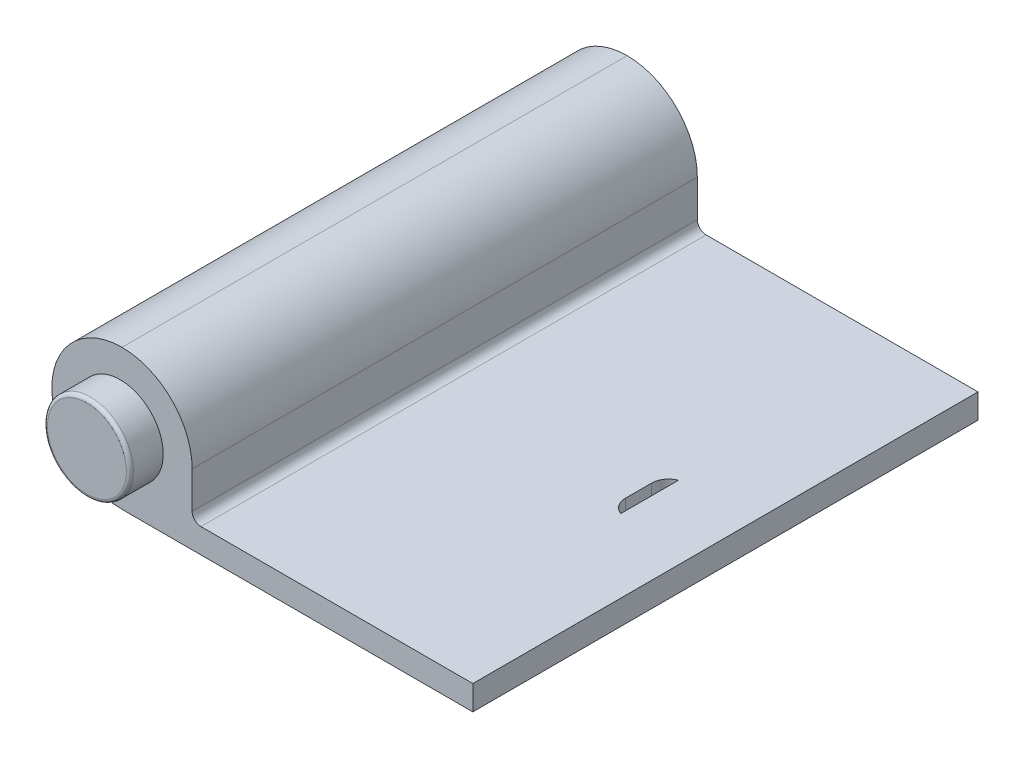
ISO-10303-21;
HEADER;
FILE_DESCRIPTION(('STEP AP214'),'2;1');
FILE_NAME('part.step','',(''),(''),'','','');
FILE_SCHEMA(('AUTOMOTIVE_DESIGN { 1 0 10303 214 1 1 1 1 }'));
ENDSEC;
DATA;
#1=APPLICATION_CONTEXT('core data for automotive mechanical design processes');
#2=APPLICATION_PROTOCOL_DEFINITION('international standard','automotive_design',2000,#1);
#3=PRODUCT_CONTEXT('',#1,'mechanical');
#4=PRODUCT('Part','Part','',(#3));
#5=PRODUCT_RELATED_PRODUCT_CATEGORY('part','',(#4));
#6=PRODUCT_DEFINITION_FORMATION('','',#4);
#7=PRODUCT_DEFINITION_CONTEXT('part definition',#1,'design');
#8=PRODUCT_DEFINITION('design','',#6,#7);
#9=PRODUCT_DEFINITION_SHAPE('','',#8);
#10=(LENGTH_UNIT() NAMED_UNIT(*) SI_UNIT(.MILLI.,.METRE.));
#11=(NAMED_UNIT(*) PLANE_ANGLE_UNIT() SI_UNIT($,.RADIAN.));
#12=(NAMED_UNIT(*) SI_UNIT($,.STERADIAN.) SOLID_ANGLE_UNIT());
#13=UNCERTAINTY_MEASURE_WITH_UNIT(LENGTH_MEASURE(1.E-05),#10,'distance_accuracy_value','');
#14=(GEOMETRIC_REPRESENTATION_CONTEXT(3) GLOBAL_UNCERTAINTY_ASSIGNED_CONTEXT((#13)) GLOBAL_UNIT_ASSIGNED_CONTEXT((#10,
#11,#12)) REPRESENTATION_CONTEXT('',''));
#15=CARTESIAN_POINT('',(0.,0.,0.));
#16=DIRECTION('',(0.,0.,1.));
#17=DIRECTION('',(1.,0.,0.));
#18=AXIS2_PLACEMENT_3D('',#15,#16,#17);
#19=CARTESIAN_POINT('',(19.8253440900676,3.63108078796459,-12.607196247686));
#20=DIRECTION('',(-1.,0.,0.));
#21=DIRECTION('',(0.,0.,1.));
#22=AXIS2_PLACEMENT_3D('',#19,#20,#21);
#23=PLANE('',#22);
#24=DIRECTION('',(0.,-1.,0.));
#25=VECTOR('',#24,1.);
#26=CARTESIAN_POINT('',(19.8253440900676,3.63108078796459,-15.892803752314));
#27=LINE('',#26,#25);
#28=CARTESIAN_POINT('',(19.8253440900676,0.,-15.892803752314));
#29=VERTEX_POINT('',#28);
#30=CARTESIAN_POINT('',(19.8253440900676,-0.7,-15.892803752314));
#31=VERTEX_POINT('',#30);
#32=EDGE_CURVE('E203',#29,#31,#27,.T.);
#33=ORIENTED_EDGE('',*,*,#32,.T.);
#34=DIRECTION('',(0.,0.,1.));
#35=VECTOR('',#34,1.);
#36=CARTESIAN_POINT('',(19.8253440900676,-0.7,-12.607196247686));
#37=LINE('',#36,#35);
#38=CARTESIAN_POINT('',(19.8253440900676,-0.699999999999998,-12.607196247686));
#39=VERTEX_POINT('',#38);
#40=EDGE_CURVE('E11',#31,#39,#37,.T.);
#41=ORIENTED_EDGE('',*,*,#40,.T.);
#42=DIRECTION('',(0.,-1.,0.));
#43=VECTOR('',#42,1.);
#44=CARTESIAN_POINT('',(19.8253440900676,3.63108078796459,-12.607196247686));
#45=LINE('',#44,#43);
#46=CARTESIAN_POINT('',(19.8253440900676,0.,-12.607196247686));
#47=VERTEX_POINT('',#46);
#48=EDGE_CURVE('E199',#47,#39,#45,.T.);
#49=ORIENTED_EDGE('',*,*,#48,.F.);
#50=DIRECTION('',(0.,-1.,0.));
#51=VECTOR('',#50,1.);
#52=CARTESIAN_POINT('',(19.8253440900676,8.,-12.607196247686));
#53=LINE('',#52,#51);
#54=CARTESIAN_POINT('',(19.8253440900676,1.4,-12.607196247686));
#55=VERTEX_POINT('',#54);
#56=EDGE_CURVE('E309',#55,#47,#53,.T.);
#57=ORIENTED_EDGE('',*,*,#56,.F.);
#58=DIRECTION('',(0.,0.,1.));
#59=VECTOR('',#58,1.);
#60=CARTESIAN_POINT('',(19.8253440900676,1.4,-28.8));
#61=LINE('',#60,#59);
#62=CARTESIAN_POINT('',(19.8253440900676,1.4,-15.892803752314));
#63=VERTEX_POINT('',#62);
#64=EDGE_CURVE('E161',#63,#55,#61,.T.);
#65=ORIENTED_EDGE('',*,*,#64,.F.);
#66=DIRECTION('',(0.,-1.,0.));
#67=VECTOR('',#66,1.);
#68=CARTESIAN_POINT('',(19.8253440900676,8.,-15.892803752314));
#69=LINE('',#68,#67);
#70=EDGE_CURVE('E307',#63,#29,#69,.T.);
#71=ORIENTED_EDGE('',*,*,#70,.T.);
#72=EDGE_LOOP('',(#33,#41,#49,#57,#65,#71));
#73=FACE_BOUND('',#72,.T.);
#74=ADVANCED_FACE('F26',(#73),#23,.T.);
#75=CARTESIAN_POINT('',(0.,1.4,0.));
#76=DIRECTION('',(0.,0.,-1.));
#77=DIRECTION('',(-1.,0.,0.));
#78=AXIS2_PLACEMENT_3D('',#75,#76,#77);
#79=PLANE('',#78);
#80=CARTESIAN_POINT('',(4.,4.,0.));
#81=DIRECTION('',(0.,0.,-1.));
#82=DIRECTION('',(-1.,0.,0.));
#83=AXIS2_PLACEMENT_3D('',#80,#81,#82);
#84=CIRCLE('',#83,4.);
#85=CARTESIAN_POINT('',(4.,8.,0.));
#86=VERTEX_POINT('',#85);
#87=CARTESIAN_POINT('',(0.,4.,0.));
#88=VERTEX_POINT('',#87);
#89=EDGE_CURVE('E511',#86,#88,#84,.F.);
#90=ORIENTED_EDGE('',*,*,#89,.T.);
#91=CARTESIAN_POINT('',(4.,4.,0.));
#92=DIRECTION('',(0.,0.,-1.));
#93=DIRECTION('',(-1.,0.,0.));
#94=AXIS2_PLACEMENT_3D('',#91,#92,#93);
#95=CIRCLE('',#94,4.);
#96=CARTESIAN_POINT('',(4.,0.,0.));
#97=VERTEX_POINT('',#96);
#98=EDGE_CURVE('E502',#88,#97,#95,.F.);
#99=ORIENTED_EDGE('',*,*,#98,.T.);
#100=DIRECTION('',(1.,0.,0.));
#101=VECTOR('',#100,1.);
#102=CARTESIAN_POINT('',(0.,0.,0.));
#103=LINE('',#102,#101);
#104=CARTESIAN_POINT('',(24.,0.,0.));
#105=VERTEX_POINT('',#104);
#106=EDGE_CURVE('E214',#97,#105,#103,.T.);
#107=ORIENTED_EDGE('',*,*,#106,.T.);
#108=DIRECTION('',(0.,-1.,0.));
#109=VECTOR('',#108,1.);
#110=CARTESIAN_POINT('',(24.,1.4,0.));
#111=LINE('',#110,#109);
#112=CARTESIAN_POINT('',(24.,1.4,0.));
#113=VERTEX_POINT('',#112);
#114=EDGE_CURVE('E491',#113,#105,#111,.T.);
#115=ORIENTED_EDGE('',*,*,#114,.F.);
#116=DIRECTION('',(1.,0.,0.));
#117=VECTOR('',#116,1.);
#118=CARTESIAN_POINT('',(0.,1.4,0.));
#119=LINE('',#118,#117);
#120=CARTESIAN_POINT('',(8.5,1.4,0.));
#121=VERTEX_POINT('',#120);
#122=EDGE_CURVE('E222',#121,#113,#119,.T.);
#123=ORIENTED_EDGE('',*,*,#122,.F.);
#124=CARTESIAN_POINT('',(8.5,1.9,0.));
#125=DIRECTION('',(0.,0.,-1.));
#126=DIRECTION('',(-1.,0.,0.));
#127=AXIS2_PLACEMENT_3D('',#124,#125,#126);
#128=CIRCLE('',#127,0.5);
#129=CARTESIAN_POINT('',(8.,1.9,0.));
#130=VERTEX_POINT('',#129);
#131=EDGE_CURVE('E236',#121,#130,#128,.T.);
#132=ORIENTED_EDGE('',*,*,#131,.T.);
#133=DIRECTION('',(0.,-1.,0.));
#134=VECTOR('',#133,1.);
#135=CARTESIAN_POINT('',(8.,8.,0.));
#136=LINE('',#135,#134);
#137=CARTESIAN_POINT('',(8.,4.,0.));
#138=VERTEX_POINT('',#137);
#139=EDGE_CURVE('E217',#138,#130,#136,.T.);
#140=ORIENTED_EDGE('',*,*,#139,.F.);
#141=CARTESIAN_POINT('',(4.,4.,0.));
#142=DIRECTION('',(0.,0.,-1.));
#143=DIRECTION('',(-1.,0.,0.));
#144=AXIS2_PLACEMENT_3D('',#141,#142,#143);
#145=CIRCLE('',#144,4.);
#146=EDGE_CURVE('E514',#138,#86,#145,.F.);
#147=ORIENTED_EDGE('',*,*,#146,.T.);
#148=EDGE_LOOP('',(#90,#99,#107,#115,#123,#132,#140,#147));
#149=FACE_BOUND('',#148,.T.);
#150=CARTESIAN_POINT('',(3.9,3.9,0.));
#151=DIRECTION('',(0.,0.,-1.));
#152=DIRECTION('',(-1.,0.,0.));
#153=AXIS2_PLACEMENT_3D('',#150,#151,#152);
#154=CIRCLE('',#153,2.45);
#155=CARTESIAN_POINT('',(1.45,3.9,0.));
#156=VERTEX_POINT('',#155);
#157=EDGE_CURVE('E238',#156,#156,#154,.F.);
#158=ORIENTED_EDGE('',*,*,#157,.F.);
#159=EDGE_LOOP('',(#158));
#160=FACE_BOUND('',#159,.T.);
#161=ADVANCED_FACE('F28',(#149,#160),#79,.F.);
#162=CARTESIAN_POINT('',(0.,1.4,-28.8));
#163=DIRECTION('',(0.,-1.,0.));
#164=DIRECTION('',(0.,0.,-1.));
#165=AXIS2_PLACEMENT_3D('',#162,#163,#164);
#166=PLANE('',#165);
#167=ORIENTED_EDGE('',*,*,#64,.T.);
#168=CARTESIAN_POINT('',(20.15,1.4,-13.5));
#169=DIRECTION('',(0.,-1.,0.));
#170=DIRECTION('',(0.,0.,-1.));
#171=AXIS2_PLACEMENT_3D('',#168,#169,#170);
#172=CIRCLE('',#171,0.95);
#173=CARTESIAN_POINT('',(19.2,1.4,-13.5));
#174=VERTEX_POINT('',#173);
#175=EDGE_CURVE('E152',#55,#174,#172,.T.);
#176=ORIENTED_EDGE('',*,*,#175,.T.);
#177=DIRECTION('',(0.,0.,-1.));
#178=VECTOR('',#177,1.);
#179=CARTESIAN_POINT('',(19.2,1.4,-28.8));
#180=LINE('',#179,#178);
#181=CARTESIAN_POINT('',(19.2,1.4,-15.));
#182=VERTEX_POINT('',#181);
#183=EDGE_CURVE('E142',#174,#182,#180,.T.);
#184=ORIENTED_EDGE('',*,*,#183,.T.);
#185=CARTESIAN_POINT('',(20.15,1.4,-15.));
#186=DIRECTION('',(0.,-1.,0.));
#187=DIRECTION('',(0.,0.,-1.));
#188=AXIS2_PLACEMENT_3D('',#185,#186,#187);
#189=CIRCLE('',#188,0.949999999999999);
#190=EDGE_CURVE('E316',#182,#63,#189,.T.);
#191=ORIENTED_EDGE('',*,*,#190,.T.);
#192=EDGE_LOOP('',(#167,#176,#184,#191));
#193=FACE_BOUND('',#192,.T.);
#194=DIRECTION('',(-1.,0.,0.));
#195=VECTOR('',#194,1.);
#196=CARTESIAN_POINT('',(0.,1.4,-28.8));
#197=LINE('',#196,#195);
#198=CARTESIAN_POINT('',(24.,1.4,-28.8));
#199=VERTEX_POINT('',#198);
#200=CARTESIAN_POINT('',(8.5,1.4,-28.8));
#201=VERTEX_POINT('',#200);
#202=EDGE_CURVE('E497',#199,#201,#197,.T.);
#203=ORIENTED_EDGE('',*,*,#202,.T.);
#204=DIRECTION('',(0.,0.,-1.));
#205=VECTOR('',#204,1.);
#206=CARTESIAN_POINT('',(8.5,1.4,0.));
#207=LINE('',#206,#205);
#208=EDGE_CURVE('E232',#201,#121,#207,.F.);
#209=ORIENTED_EDGE('',*,*,#208,.T.);
#210=ORIENTED_EDGE('',*,*,#122,.T.);
#211=DIRECTION('',(0.,0.,-1.));
#212=VECTOR('',#211,1.);
#213=CARTESIAN_POINT('',(24.,1.4,0.));
#214=LINE('',#213,#212);
#215=EDGE_CURVE('E225',#113,#199,#214,.T.);
#216=ORIENTED_EDGE('',*,*,#215,.T.);
#217=EDGE_LOOP('',(#203,#209,#210,#216));
#218=FACE_BOUND('',#217,.T.);
#219=ADVANCED_FACE('F159',(#193,#218),#166,.F.);
#220=CARTESIAN_POINT('',(24.,1.4,0.));
#221=DIRECTION('',(-1.,0.,0.));
#222=DIRECTION('',(0.,0.,1.));
#223=AXIS2_PLACEMENT_3D('',#220,#221,#222);
#224=PLANE('',#223);
#225=DIRECTION('',(0.,0.,-1.));
#226=VECTOR('',#225,1.);
#227=CARTESIAN_POINT('',(24.,0.,0.));
#228=LINE('',#227,#226);
#229=CARTESIAN_POINT('',(24.,0.,-28.8));
#230=VERTEX_POINT('',#229);
#231=EDGE_CURVE('E216',#105,#230,#228,.T.);
#232=ORIENTED_EDGE('',*,*,#231,.T.);
#233=DIRECTION('',(0.,-1.,0.));
#234=VECTOR('',#233,1.);
#235=CARTESIAN_POINT('',(24.,1.4,-28.8));
#236=LINE('',#235,#234);
#237=EDGE_CURVE('E488',#199,#230,#236,.T.);
#238=ORIENTED_EDGE('',*,*,#237,.F.);
#239=ORIENTED_EDGE('',*,*,#215,.F.);
#240=ORIENTED_EDGE('',*,*,#114,.T.);
#241=EDGE_LOOP('',(#232,#238,#239,#240));
#242=FACE_BOUND('',#241,.T.);
#243=ADVANCED_FACE('F424',(#242),#224,.F.);
#244=CARTESIAN_POINT('',(0.,1.4,-28.8));
#245=DIRECTION('',(0.,0.,1.));
#246=DIRECTION('',(1.,0.,0.));
#247=AXIS2_PLACEMENT_3D('',#244,#245,#246);
#248=PLANE('',#247);
#249=CARTESIAN_POINT('',(3.9,3.9,-28.8));
#250=DIRECTION('',(0.,0.,-1.));
#251=DIRECTION('',(-1.,0.,0.));
#252=AXIS2_PLACEMENT_3D('',#249,#250,#251);
#253=CIRCLE('',#252,2.45);
#254=CARTESIAN_POINT('',(1.45,3.9,-28.8));
#255=VERTEX_POINT('',#254);
#256=EDGE_CURVE('E191',#255,#255,#253,.T.);
#257=ORIENTED_EDGE('',*,*,#256,.F.);
#258=EDGE_LOOP('',(#257));
#259=FACE_BOUND('',#258,.T.);
#260=DIRECTION('',(-1.,0.,0.));
#261=VECTOR('',#260,1.);
#262=CARTESIAN_POINT('',(0.,0.,-28.8));
#263=LINE('',#262,#261);
#264=CARTESIAN_POINT('',(4.,0.,-28.8));
#265=VERTEX_POINT('',#264);
#266=EDGE_CURVE('E219',#230,#265,#263,.T.);
#267=ORIENTED_EDGE('',*,*,#266,.T.);
#268=CARTESIAN_POINT('',(4.,4.,-28.8));
#269=DIRECTION('',(0.,0.,1.));
#270=DIRECTION('',(1.,0.,0.));
#271=AXIS2_PLACEMENT_3D('',#268,#269,#270);
#272=CIRCLE('',#271,4.);
#273=CARTESIAN_POINT('',(0.,4.,-28.8));
#274=VERTEX_POINT('',#273);
#275=EDGE_CURVE('E501',#265,#274,#272,.F.);
#276=ORIENTED_EDGE('',*,*,#275,.T.);
#277=CARTESIAN_POINT('',(4.,4.,-28.8));
#278=DIRECTION('',(0.,0.,1.));
#279=DIRECTION('',(1.,0.,0.));
#280=AXIS2_PLACEMENT_3D('',#277,#278,#279);
#281=CIRCLE('',#280,4.);
#282=CARTESIAN_POINT('',(4.,8.,-28.8));
#283=VERTEX_POINT('',#282);
#284=EDGE_CURVE('E504',#274,#283,#281,.F.);
#285=ORIENTED_EDGE('',*,*,#284,.T.);
#286=CARTESIAN_POINT('',(4.,4.,-28.8));
#287=DIRECTION('',(0.,0.,1.));
#288=DIRECTION('',(1.,0.,0.));
#289=AXIS2_PLACEMENT_3D('',#286,#287,#288);
#290=CIRCLE('',#289,4.);
#291=CARTESIAN_POINT('',(8.,4.,-28.8));
#292=VERTEX_POINT('',#291);
#293=EDGE_CURVE('E519',#283,#292,#290,.F.);
#294=ORIENTED_EDGE('',*,*,#293,.T.);
#295=DIRECTION('',(0.,-1.,0.));
#296=VECTOR('',#295,1.);
#297=CARTESIAN_POINT('',(8.,8.,-28.8));
#298=LINE('',#297,#296);
#299=CARTESIAN_POINT('',(8.,1.9,-28.8));
#300=VERTEX_POINT('',#299);
#301=EDGE_CURVE('E213',#292,#300,#298,.T.);
#302=ORIENTED_EDGE('',*,*,#301,.T.);
#303=CARTESIAN_POINT('',(8.5,1.9,-28.8));
#304=DIRECTION('',(0.,0.,1.));
#305=DIRECTION('',(1.,0.,0.));
#306=AXIS2_PLACEMENT_3D('',#303,#304,#305);
#307=CIRCLE('',#306,0.5);
#308=EDGE_CURVE('E234',#300,#201,#307,.T.);
#309=ORIENTED_EDGE('',*,*,#308,.T.);
#310=ORIENTED_EDGE('',*,*,#202,.F.);
#311=ORIENTED_EDGE('',*,*,#237,.T.);
#312=EDGE_LOOP('',(#267,#276,#285,#294,#302,#309,#310,#311));
#313=FACE_BOUND('',#312,.T.);
#314=ADVANCED_FACE('F421',(#259,#313),#248,.F.);
#315=CARTESIAN_POINT('',(0.,0.,-28.8));
#316=DIRECTION('',(0.,-1.,0.));
#317=DIRECTION('',(0.,0.,-1.));
#318=AXIS2_PLACEMENT_3D('',#315,#316,#317);
#319=PLANE('',#318);
#320=CARTESIAN_POINT('',(20.15,0.,-13.5));
#321=DIRECTION('',(0.,-1.,0.));
#322=DIRECTION('',(0.,0.,-1.));
#323=AXIS2_PLACEMENT_3D('',#320,#321,#322);
#324=CIRCLE('',#323,0.95);
#325=CARTESIAN_POINT('',(19.2,0.,-13.5));
#326=VERTEX_POINT('',#325);
#327=EDGE_CURVE('E155',#47,#326,#324,.T.);
#328=ORIENTED_EDGE('',*,*,#327,.F.);
#329=CARTESIAN_POINT('',(20.15,0.,-13.5));
#330=DIRECTION('',(0.,-1.,0.));
#331=DIRECTION('',(0.,0.,-1.));
#332=AXIS2_PLACEMENT_3D('',#329,#330,#331);
#333=CIRCLE('',#332,0.95);
#334=CARTESIAN_POINT('',(21.1,0.,-13.5));
#335=VERTEX_POINT('',#334);
#336=EDGE_CURVE('E189',#47,#335,#333,.F.);
#337=ORIENTED_EDGE('',*,*,#336,.T.);
#338=DIRECTION('',(0.,0.,-1.));
#339=VECTOR('',#338,1.);
#340=CARTESIAN_POINT('',(21.1,0.,-13.5));
#341=LINE('',#340,#339);
#342=CARTESIAN_POINT('',(21.1,0.,-15.));
#343=VERTEX_POINT('',#342);
#344=EDGE_CURVE('E186',#335,#343,#341,.T.);
#345=ORIENTED_EDGE('',*,*,#344,.T.);
#346=CARTESIAN_POINT('',(20.15,0.,-15.));
#347=DIRECTION('',(0.,-1.,0.));
#348=DIRECTION('',(0.,0.,-1.));
#349=AXIS2_PLACEMENT_3D('',#346,#347,#348);
#350=CIRCLE('',#349,0.95);
#351=EDGE_CURVE('E183',#343,#29,#350,.F.);
#352=ORIENTED_EDGE('',*,*,#351,.T.);
#353=CARTESIAN_POINT('',(20.15,0.,-15.));
#354=DIRECTION('',(0.,-1.,0.));
#355=DIRECTION('',(0.,0.,-1.));
#356=AXIS2_PLACEMENT_3D('',#353,#354,#355);
#357=CIRCLE('',#356,0.949999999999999);
#358=CARTESIAN_POINT('',(19.2,0.,-15.));
#359=VERTEX_POINT('',#358);
#360=EDGE_CURVE('E147',#359,#29,#357,.T.);
#361=ORIENTED_EDGE('',*,*,#360,.F.);
#362=DIRECTION('',(0.,0.,-1.));
#363=VECTOR('',#362,1.);
#364=CARTESIAN_POINT('',(19.2,0.,-28.8));
#365=LINE('',#364,#363);
#366=EDGE_CURVE('E148',#326,#359,#365,.T.);
#367=ORIENTED_EDGE('',*,*,#366,.F.);
#368=EDGE_LOOP('',(#328,#337,#345,#352,#361,#367));
#369=FACE_BOUND('',#368,.T.);
#370=ORIENTED_EDGE('',*,*,#106,.F.);
#371=DIRECTION('',(0.,0.,1.));
#372=VECTOR('',#371,1.);
#373=CARTESIAN_POINT('',(4.,0.,-28.8));
#374=LINE('',#373,#372);
#375=EDGE_CURVE('E500',#97,#265,#374,.F.);
#376=ORIENTED_EDGE('',*,*,#375,.T.);
#377=ORIENTED_EDGE('',*,*,#266,.F.);
#378=ORIENTED_EDGE('',*,*,#231,.F.);
#379=EDGE_LOOP('',(#370,#376,#377,#378));
#380=FACE_BOUND('',#379,.T.);
#381=ADVANCED_FACE('F298',(#369,#380),#319,.T.);
#382=CARTESIAN_POINT('',(8.,8.,-28.8));
#383=DIRECTION('',(-1.,0.,0.));
#384=DIRECTION('',(0.,0.,1.));
#385=AXIS2_PLACEMENT_3D('',#382,#383,#384);
#386=PLANE('',#385);
#387=ORIENTED_EDGE('',*,*,#139,.T.);
#388=DIRECTION('',(0.,0.,-1.));
#389=VECTOR('',#388,1.);
#390=CARTESIAN_POINT('',(8.,1.9,-28.8));
#391=LINE('',#390,#389);
#392=EDGE_CURVE('E230',#130,#300,#391,.T.);
#393=ORIENTED_EDGE('',*,*,#392,.T.);
#394=ORIENTED_EDGE('',*,*,#301,.F.);
#395=DIRECTION('',(0.,0.,-1.));
#396=VECTOR('',#395,1.);
#397=CARTESIAN_POINT('',(8.,4.,0.));
#398=LINE('',#397,#396);
#399=EDGE_CURVE('E517',#292,#138,#398,.F.);
#400=ORIENTED_EDGE('',*,*,#399,.T.);
#401=EDGE_LOOP('',(#387,#393,#394,#400));
#402=FACE_BOUND('',#401,.T.);
#403=ADVANCED_FACE('F410',(#402),#386,.F.);
#404=CARTESIAN_POINT('',(4.,4.,0.));
#405=DIRECTION('',(0.,0.,1.));
#406=DIRECTION('',(1.,0.,0.));
#407=AXIS2_PLACEMENT_3D('',#404,#405,#406);
#408=CYLINDRICAL_SURFACE('',#407,4.);
#409=ORIENTED_EDGE('',*,*,#146,.F.);
#410=ORIENTED_EDGE('',*,*,#399,.F.);
#411=ORIENTED_EDGE('',*,*,#293,.F.);
#412=DIRECTION('',(0.,0.,-1.));
#413=VECTOR('',#412,1.);
#414=CARTESIAN_POINT('',(4.,8.,-28.8));
#415=LINE('',#414,#413);
#416=EDGE_CURVE('E529',#86,#283,#415,.T.);
#417=ORIENTED_EDGE('',*,*,#416,.F.);
#418=EDGE_LOOP('',(#409,#410,#411,#417));
#419=FACE_BOUND('',#418,.T.);
#420=ADVANCED_FACE('F414',(#419),#408,.T.);
#421=CARTESIAN_POINT('',(4.,4.,0.));
#422=DIRECTION('',(0.,0.,-1.));
#423=DIRECTION('',(-1.,0.,0.));
#424=AXIS2_PLACEMENT_3D('',#421,#422,#423);
#425=CYLINDRICAL_SURFACE('',#424,4.);
#426=ORIENTED_EDGE('',*,*,#284,.F.);
#427=DIRECTION('',(0.,0.,1.));
#428=VECTOR('',#427,1.);
#429=CARTESIAN_POINT('',(0.,4.,-28.8));
#430=LINE('',#429,#428);
#431=EDGE_CURVE('E508',#88,#274,#430,.F.);
#432=ORIENTED_EDGE('',*,*,#431,.F.);
#433=ORIENTED_EDGE('',*,*,#89,.F.);
#434=ORIENTED_EDGE('',*,*,#416,.T.);
#435=EDGE_LOOP('',(#426,#432,#433,#434));
#436=FACE_BOUND('',#435,.T.);
#437=ADVANCED_FACE('F449',(#436),#425,.T.);
#438=CARTESIAN_POINT('',(4.,4.,0.));
#439=DIRECTION('',(0.,0.,-1.));
#440=DIRECTION('',(-1.,0.,0.));
#441=AXIS2_PLACEMENT_3D('',#438,#439,#440);
#442=CYLINDRICAL_SURFACE('',#441,4.);
#443=ORIENTED_EDGE('',*,*,#275,.F.);
#444=ORIENTED_EDGE('',*,*,#375,.F.);
#445=ORIENTED_EDGE('',*,*,#98,.F.);
#446=ORIENTED_EDGE('',*,*,#431,.T.);
#447=EDGE_LOOP('',(#443,#444,#445,#446));
#448=FACE_BOUND('',#447,.T.);
#449=ADVANCED_FACE('F441',(#448),#442,.T.);
#450=CARTESIAN_POINT('',(3.9,3.9,-1.1));
#451=DIRECTION('',(0.,0.,-1.));
#452=DIRECTION('',(-1.,0.,0.));
#453=AXIS2_PLACEMENT_3D('',#450,#451,#452);
#454=CYLINDRICAL_SURFACE('',#453,2.45);
#455=CARTESIAN_POINT('',(3.9,3.9,-1.1));
#456=DIRECTION('',(0.,0.,-1.));
#457=DIRECTION('',(-1.,0.,0.));
#458=AXIS2_PLACEMENT_3D('',#455,#456,#457);
#459=CIRCLE('',#458,2.45);
#460=CARTESIAN_POINT('',(1.45,3.9,-1.1));
#461=VERTEX_POINT('',#460);
#462=EDGE_CURVE('E210',#461,#461,#459,.T.);
#463=ORIENTED_EDGE('',*,*,#462,.F.);
#464=EDGE_LOOP('',(#463));
#465=FACE_BOUND('',#464,.T.);
#466=ORIENTED_EDGE('',*,*,#256,.T.);
#467=EDGE_LOOP('',(#466));
#468=FACE_BOUND('',#467,.T.);
#469=ADVANCED_FACE('F433',(#465,#468),#454,.F.);
#470=CARTESIAN_POINT('',(3.9,3.9,-1.1));
#471=DIRECTION('',(0.,0.,-1.));
#472=DIRECTION('',(-1.,0.,0.));
#473=AXIS2_PLACEMENT_3D('',#470,#471,#472);
#474=PLANE('',#473);
#475=ORIENTED_EDGE('',*,*,#462,.T.);
#476=EDGE_LOOP('',(#475));
#477=FACE_BOUND('',#476,.T.);
#478=ADVANCED_FACE('F404',(#477),#474,.T.);
#479=CARTESIAN_POINT('',(8.5,1.9,-28.8));
#480=DIRECTION('',(0.,0.,1.));
#481=DIRECTION('',(1.,0.,0.));
#482=AXIS2_PLACEMENT_3D('',#479,#480,#481);
#483=CYLINDRICAL_SURFACE('',#482,0.5);
#484=ORIENTED_EDGE('',*,*,#131,.F.);
#485=ORIENTED_EDGE('',*,*,#208,.F.);
#486=ORIENTED_EDGE('',*,*,#308,.F.);
#487=ORIENTED_EDGE('',*,*,#392,.F.);
#488=EDGE_LOOP('',(#484,#485,#486,#487));
#489=FACE_BOUND('',#488,.T.);
#490=ADVANCED_FACE('F262',(#489),#483,.F.);
#491=CARTESIAN_POINT('',(3.9,3.9,1.9));
#492=DIRECTION('',(0.,0.,-1.));
#493=DIRECTION('',(-1.,0.,0.));
#494=AXIS2_PLACEMENT_3D('',#491,#492,#493);
#495=CYLINDRICAL_SURFACE('',#494,2.45);
#496=CARTESIAN_POINT('',(3.9,3.9,1.7));
#497=DIRECTION('',(0.,0.,1.));
#498=DIRECTION('',(1.,0.,0.));
#499=AXIS2_PLACEMENT_3D('',#496,#497,#498);
#500=CIRCLE('',#499,2.45);
#501=CARTESIAN_POINT('',(1.45,3.9,1.7));
#502=VERTEX_POINT('',#501);
#503=EDGE_CURVE('E34',#502,#502,#500,.F.);
#504=CARTESIAN_POINT('',(1.45,3.9,1.7));
#505=CARTESIAN_POINT('',(1.45,3.9,1.68229166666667));
#506=CARTESIAN_POINT('',(1.45,3.9,1.66458333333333));
#507=CARTESIAN_POINT('',(1.45,3.9,1.62916666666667));
#508=CARTESIAN_POINT('',(1.45,3.9,1.61145833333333));
#509=CARTESIAN_POINT('',(1.45,3.9,1.57604166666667));
#510=CARTESIAN_POINT('',(1.45,3.9,1.55833333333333));
#511=CARTESIAN_POINT('',(1.45,3.9,1.52291666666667));
#512=CARTESIAN_POINT('',(1.45,3.9,1.50520833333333));
#513=CARTESIAN_POINT('',(1.45,3.9,1.46979166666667));
#514=CARTESIAN_POINT('',(1.45,3.9,1.45208333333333));
#515=CARTESIAN_POINT('',(1.45,3.9,1.41666666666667));
#516=CARTESIAN_POINT('',(1.45,3.9,1.39895833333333));
#517=CARTESIAN_POINT('',(1.45,3.9,1.36354166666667));
#518=CARTESIAN_POINT('',(1.45,3.9,1.34583333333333));
#519=CARTESIAN_POINT('',(1.45,3.9,1.31041666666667));
#520=CARTESIAN_POINT('',(1.45,3.9,1.29270833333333));
#521=CARTESIAN_POINT('',(1.45,3.9,1.25729166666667));
#522=CARTESIAN_POINT('',(1.45,3.9,1.23958333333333));
#523=CARTESIAN_POINT('',(1.45,3.9,1.20416666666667));
#524=CARTESIAN_POINT('',(1.45,3.9,1.18645833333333));
#525=CARTESIAN_POINT('',(1.45,3.9,1.15104166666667));
#526=CARTESIAN_POINT('',(1.45,3.9,1.13333333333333));
#527=CARTESIAN_POINT('',(1.45,3.9,1.09791666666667));
#528=CARTESIAN_POINT('',(1.45,3.9,1.08020833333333));
#529=CARTESIAN_POINT('',(1.45,3.9,1.04479166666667));
#530=CARTESIAN_POINT('',(1.45,3.9,1.02708333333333));
#531=CARTESIAN_POINT('',(1.45,3.9,0.991666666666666));
#532=CARTESIAN_POINT('',(1.45,3.9,0.973958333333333));
#533=CARTESIAN_POINT('',(1.45,3.9,0.938541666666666));
#534=CARTESIAN_POINT('',(1.45,3.9,0.920833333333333));
#535=CARTESIAN_POINT('',(1.45,3.9,0.885416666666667));
#536=CARTESIAN_POINT('',(1.45,3.9,0.867708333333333));
#537=CARTESIAN_POINT('',(1.45,3.9,0.832291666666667));
#538=CARTESIAN_POINT('',(1.45,3.9,0.814583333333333));
#539=CARTESIAN_POINT('',(1.45,3.9,0.779166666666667));
#540=CARTESIAN_POINT('',(1.45,3.9,0.761458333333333));
#541=CARTESIAN_POINT('',(1.45,3.9,0.726041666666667));
#542=CARTESIAN_POINT('',(1.45,3.9,0.708333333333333));
#543=CARTESIAN_POINT('',(1.45,3.9,0.672916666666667));
#544=CARTESIAN_POINT('',(1.45,3.9,0.655208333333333));
#545=CARTESIAN_POINT('',(1.45,3.9,0.619791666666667));
#546=CARTESIAN_POINT('',(1.45,3.9,0.602083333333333));
#547=CARTESIAN_POINT('',(1.45,3.9,0.566666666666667));
#548=CARTESIAN_POINT('',(1.45,3.9,0.548958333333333));
#549=CARTESIAN_POINT('',(1.45,3.9,0.513541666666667));
#550=CARTESIAN_POINT('',(1.45,3.9,0.495833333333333));
#551=CARTESIAN_POINT('',(1.45,3.9,0.460416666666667));
#552=CARTESIAN_POINT('',(1.45,3.9,0.442708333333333));
#553=CARTESIAN_POINT('',(1.45,3.9,0.407291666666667));
#554=CARTESIAN_POINT('',(1.45,3.9,0.389583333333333));
#555=CARTESIAN_POINT('',(1.45,3.9,0.354166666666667));
#556=CARTESIAN_POINT('',(1.45,3.9,0.336458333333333));
#557=CARTESIAN_POINT('',(1.45,3.9,0.301041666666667));
#558=CARTESIAN_POINT('',(1.45,3.9,0.283333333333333));
#559=CARTESIAN_POINT('',(1.45,3.9,0.247916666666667));
#560=CARTESIAN_POINT('',(1.45,3.9,0.230208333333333));
#561=CARTESIAN_POINT('',(1.45,3.9,0.194791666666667));
#562=CARTESIAN_POINT('',(1.45,3.9,0.177083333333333));
#563=CARTESIAN_POINT('',(1.45,3.9,0.141666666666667));
#564=CARTESIAN_POINT('',(1.45,3.9,0.123958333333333));
#565=CARTESIAN_POINT('',(1.45,3.9,0.0885416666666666));
#566=CARTESIAN_POINT('',(1.45,3.9,0.0708333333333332));
#567=CARTESIAN_POINT('',(1.45,3.9,0.0354166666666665));
#568=CARTESIAN_POINT('',(1.45,3.9,0.0177083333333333));
#569=CARTESIAN_POINT('',(1.45,3.9,0.));
#570=B_SPLINE_CURVE_WITH_KNOTS('',3,(#504,#505,#506,#507,#508,#509,#510,#511,#512,#513,#514,
#515,#516,#517,#518,#519,#520,#521,#522,#523,#524,#525,#526,#527,#528,#529,#530,#531,#532,#533,
#534,#535,#536,#537,#538,#539,#540,#541,#542,#543,#544,#545,#546,#547,#548,#549,#550,#551,#552,
#553,#554,#555,#556,#557,#558,#559,#560,#561,#562,#563,#564,#565,#566,#567,#568,#569),
.UNSPECIFIED.,.F.,.F.,(4,2,2,2,2,2,2,2,2,2,2,2,2,2,2,2,2,2,2,2,2,2,2,2,2,2,2,2,2,2,2,2,4),(0.,
0.053125,0.10625,0.159375,0.2125,0.265625,0.31875,0.371875,0.425,0.478125,0.53125,0.584375,
0.6375,0.690625,0.74375,0.796875,0.85,0.903125,0.95625,1.009375,1.0625,1.115625,1.16875,
1.221875,1.275,1.328125,1.38125,1.434375,1.4875,1.540625,1.59375,1.646875,1.7),.UNSPECIFIED.);
#571=EDGE_CURVE('BSEAM246',#502,#156,#570,.T.);
#572=ORIENTED_EDGE('',*,*,#503,.T.);
#573=ORIENTED_EDGE('',*,*,#157,.T.);
#574=ORIENTED_EDGE('',*,*,#571,.T.);
#575=ORIENTED_EDGE('',*,*,#571,.F.);
#576=EDGE_LOOP('',(#572,#574,#573,#575));
#577=FACE_BOUND('',#576,.T.);
#578=ADVANCED_FACE('F246',(#577),#495,.T.);
#579=CARTESIAN_POINT('',(3.9,3.9,1.9));
#580=DIRECTION('',(0.,0.,1.));
#581=DIRECTION('',(1.,0.,0.));
#582=AXIS2_PLACEMENT_3D('',#579,#580,#581);
#583=PLANE('',#582);
#584=CARTESIAN_POINT('',(3.9,3.9,1.9));
#585=DIRECTION('',(0.,0.,1.));
#586=DIRECTION('',(1.,0.,0.));
#587=AXIS2_PLACEMENT_3D('',#584,#585,#586);
#588=CIRCLE('',#587,2.25);
#589=CARTESIAN_POINT('',(6.15,3.9,1.9));
#590=VERTEX_POINT('',#589);
#591=EDGE_CURVE('E241',#590,#590,#588,.T.);
#592=ORIENTED_EDGE('',*,*,#591,.T.);
#593=EDGE_LOOP('',(#592));
#594=FACE_BOUND('',#593,.T.);
#595=ADVANCED_FACE('F253',(#594),#583,.T.);
#596=CARTESIAN_POINT('',(3.9,3.9,1.7));
#597=DIRECTION('',(0.,0.,1.));
#598=DIRECTION('',(1.,0.,0.));
#599=AXIS2_PLACEMENT_3D('',#596,#597,#598);
#600=TOROIDAL_SURFACE('',#599,2.25,0.2);
#601=ORIENTED_EDGE('',*,*,#503,.F.);
#602=EDGE_LOOP('',(#601));
#603=FACE_BOUND('',#602,.T.);
#604=ORIENTED_EDGE('',*,*,#591,.F.);
#605=EDGE_LOOP('',(#604));
#606=FACE_BOUND('',#605,.T.);
#607=ADVANCED_FACE('F249',(#603,#606),#600,.T.);
#608=CARTESIAN_POINT('',(20.15,3.63108078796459,-13.5));
#609=DIRECTION('',(0.,-1.,0.));
#610=DIRECTION('',(0.,0.,-1.));
#611=AXIS2_PLACEMENT_3D('',#608,#609,#610);
#612=CYLINDRICAL_SURFACE('',#611,0.95);
#613=CARTESIAN_POINT('',(20.15,-1.8,-13.5));
#614=DIRECTION('',(0.,-1.,0.));
#615=DIRECTION('',(0.,0.,-1.));
#616=AXIS2_PLACEMENT_3D('',#613,#614,#615);
#617=CIRCLE('',#616,0.95);
#618=CARTESIAN_POINT('',(21.1,-1.8,-13.5));
#619=VERTEX_POINT('',#618);
#620=CARTESIAN_POINT('',(19.2,-1.8,-13.5));
#621=VERTEX_POINT('',#620);
#622=EDGE_CURVE('E182',#619,#621,#617,.T.);
#623=ORIENTED_EDGE('',*,*,#622,.F.);
#624=DIRECTION('',(0.,-1.,0.));
#625=VECTOR('',#624,1.);
#626=CARTESIAN_POINT('',(21.1,3.63108078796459,-13.5));
#627=LINE('',#626,#625);
#628=EDGE_CURVE('E187',#335,#619,#627,.T.);
#629=ORIENTED_EDGE('',*,*,#628,.F.);
#630=ORIENTED_EDGE('',*,*,#336,.F.);
#631=ORIENTED_EDGE('',*,*,#48,.T.);
#632=CARTESIAN_POINT('',(20.15,-0.7,-13.5));
#633=DIRECTION('',(0.,-1.,0.));
#634=DIRECTION('',(0.,0.,-1.));
#635=AXIS2_PLACEMENT_3D('',#632,#633,#634);
#636=CIRCLE('',#635,0.95);
#637=CARTESIAN_POINT('',(19.2,-0.7,-13.5));
#638=VERTEX_POINT('',#637);
#639=EDGE_CURVE('E162',#39,#638,#636,.T.);
#640=ORIENTED_EDGE('',*,*,#639,.T.);
#641=DIRECTION('',(0.,1.,0.));
#642=VECTOR('',#641,1.);
#643=CARTESIAN_POINT('',(19.2,-1.8,-13.5));
#644=LINE('',#643,#642);
#645=EDGE_CURVE('E179',#621,#638,#644,.T.);
#646=ORIENTED_EDGE('',*,*,#645,.F.);
#647=EDGE_LOOP('',(#623,#629,#630,#631,#640,#646));
#648=FACE_BOUND('',#647,.T.);
#649=ADVANCED_FACE('F252',(#648),#612,.T.);
#650=CARTESIAN_POINT('',(21.1,3.63108078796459,-13.5));
#651=DIRECTION('',(1.,0.,0.));
#652=DIRECTION('',(0.,0.,-1.));
#653=AXIS2_PLACEMENT_3D('',#650,#651,#652);
#654=PLANE('',#653);
#655=DIRECTION('',(0.,0.,1.));
#656=VECTOR('',#655,1.);
#657=CARTESIAN_POINT('',(21.1,-1.8,-13.5));
#658=LINE('',#657,#656);
#659=CARTESIAN_POINT('',(21.1,-1.8,-15.));
#660=VERTEX_POINT('',#659);
#661=EDGE_CURVE('E196',#660,#619,#658,.T.);
#662=ORIENTED_EDGE('',*,*,#661,.F.);
#663=DIRECTION('',(0.,-1.,0.));
#664=VECTOR('',#663,1.);
#665=CARTESIAN_POINT('',(21.1,3.63108078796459,-15.));
#666=LINE('',#665,#664);
#667=EDGE_CURVE('E201',#343,#660,#666,.T.);
#668=ORIENTED_EDGE('',*,*,#667,.F.);
#669=ORIENTED_EDGE('',*,*,#344,.F.);
#670=ORIENTED_EDGE('',*,*,#628,.T.);
#671=EDGE_LOOP('',(#662,#668,#669,#670));
#672=FACE_BOUND('',#671,.T.);
#673=ADVANCED_FACE('F278',(#672),#654,.T.);
#674=CARTESIAN_POINT('',(20.15,3.63108078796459,-15.));
#675=DIRECTION('',(0.,-1.,0.));
#676=DIRECTION('',(0.,0.,-1.));
#677=AXIS2_PLACEMENT_3D('',#674,#675,#676);
#678=CYLINDRICAL_SURFACE('',#677,0.95);
#679=CARTESIAN_POINT('',(20.15,-0.7,-15.));
#680=DIRECTION('',(0.,-1.,0.));
#681=DIRECTION('',(0.,0.,-1.));
#682=AXIS2_PLACEMENT_3D('',#679,#680,#681);
#683=CIRCLE('',#682,0.95);
#684=CARTESIAN_POINT('',(19.2,-0.7,-15.));
#685=VERTEX_POINT('',#684);
#686=EDGE_CURVE('E170',#685,#31,#683,.T.);
#687=ORIENTED_EDGE('',*,*,#686,.T.);
#688=ORIENTED_EDGE('',*,*,#32,.F.);
#689=ORIENTED_EDGE('',*,*,#351,.F.);
#690=ORIENTED_EDGE('',*,*,#667,.T.);
#691=CARTESIAN_POINT('',(20.15,-1.8,-15.));
#692=DIRECTION('',(0.,-1.,0.));
#693=DIRECTION('',(0.,0.,1.));
#694=AXIS2_PLACEMENT_3D('',#691,#692,#693);
#695=CIRCLE('',#694,0.95);
#696=CARTESIAN_POINT('',(19.2,-1.8,-15.));
#697=VERTEX_POINT('',#696);
#698=EDGE_CURVE('E193',#697,#660,#695,.T.);
#699=ORIENTED_EDGE('',*,*,#698,.F.);
#700=DIRECTION('',(0.,1.,0.));
#701=VECTOR('',#700,1.);
#702=CARTESIAN_POINT('',(19.2,-1.8,-15.));
#703=LINE('',#702,#701);
#704=EDGE_CURVE('E176',#697,#685,#703,.T.);
#705=ORIENTED_EDGE('',*,*,#704,.T.);
#706=EDGE_LOOP('',(#687,#688,#689,#690,#699,#705));
#707=FACE_BOUND('',#706,.T.);
#708=ADVANCED_FACE('F275',(#707),#678,.T.);
#709=CARTESIAN_POINT('',(20.15,-1.8,-13.5));
#710=DIRECTION('',(0.,-1.,0.));
#711=DIRECTION('',(0.,0.,-1.));
#712=AXIS2_PLACEMENT_3D('',#709,#710,#711);
#713=PLANE('',#712);
#714=ORIENTED_EDGE('',*,*,#622,.T.);
#715=DIRECTION('',(0.,0.,-1.));
#716=VECTOR('',#715,1.);
#717=CARTESIAN_POINT('',(19.2,-1.8,-13.5));
#718=LINE('',#717,#716);
#719=EDGE_CURVE('E173',#621,#697,#718,.T.);
#720=ORIENTED_EDGE('',*,*,#719,.T.);
#721=ORIENTED_EDGE('',*,*,#698,.T.);
#722=ORIENTED_EDGE('',*,*,#661,.T.);
#723=EDGE_LOOP('',(#714,#720,#721,#722));
#724=FACE_BOUND('',#723,.T.);
#725=ADVANCED_FACE('F293',(#724),#713,.T.);
#726=CARTESIAN_POINT('',(19.2,-1.8,-13.5));
#727=DIRECTION('',(1.,0.,0.));
#728=DIRECTION('',(0.,0.,-1.));
#729=AXIS2_PLACEMENT_3D('',#726,#727,#728);
#730=PLANE('',#729);
#731=DIRECTION('',(0.,0.,-1.));
#732=VECTOR('',#731,1.);
#733=CARTESIAN_POINT('',(19.2,-0.7,-13.5));
#734=LINE('',#733,#732);
#735=EDGE_CURVE('E164',#638,#685,#734,.T.);
#736=ORIENTED_EDGE('',*,*,#735,.T.);
#737=ORIENTED_EDGE('',*,*,#704,.F.);
#738=ORIENTED_EDGE('',*,*,#719,.F.);
#739=ORIENTED_EDGE('',*,*,#645,.T.);
#740=EDGE_LOOP('',(#736,#737,#738,#739));
#741=FACE_BOUND('',#740,.T.);
#742=ADVANCED_FACE('F323',(#741),#730,.F.);
#743=CARTESIAN_POINT('',(20.15,-0.7,-13.5));
#744=DIRECTION('',(0.,-1.,0.));
#745=DIRECTION('',(0.,0.,-1.));
#746=AXIS2_PLACEMENT_3D('',#743,#744,#745);
#747=PLANE('',#746);
#748=ORIENTED_EDGE('',*,*,#40,.F.);
#749=ORIENTED_EDGE('',*,*,#686,.F.);
#750=ORIENTED_EDGE('',*,*,#735,.F.);
#751=ORIENTED_EDGE('',*,*,#639,.F.);
#752=EDGE_LOOP('',(#748,#749,#750,#751));
#753=FACE_BOUND('',#752,.T.);
#754=ADVANCED_FACE('F320',(#753),#747,.F.);
#755=CARTESIAN_POINT('',(20.15,8.,-13.5));
#756=DIRECTION('',(0.,-1.,0.));
#757=DIRECTION('',(0.,0.,-1.));
#758=AXIS2_PLACEMENT_3D('',#755,#756,#757);
#759=CYLINDRICAL_SURFACE('',#758,0.95);
#760=ORIENTED_EDGE('',*,*,#56,.T.);
#761=ORIENTED_EDGE('',*,*,#327,.T.);
#762=DIRECTION('',(0.,-1.,0.));
#763=VECTOR('',#762,1.);
#764=CARTESIAN_POINT('',(19.2,8.,-13.5));
#765=LINE('',#764,#763);
#766=EDGE_CURVE('E46',#174,#326,#765,.T.);
#767=ORIENTED_EDGE('',*,*,#766,.F.);
#768=ORIENTED_EDGE('',*,*,#175,.F.);
#769=EDGE_LOOP('',(#760,#761,#767,#768));
#770=FACE_BOUND('',#769,.T.);
#771=ADVANCED_FACE('F151',(#770),#759,.F.);
#772=CARTESIAN_POINT('',(20.15,8.,-15.));
#773=DIRECTION('',(0.,-1.,0.));
#774=DIRECTION('',(0.,0.,-1.));
#775=AXIS2_PLACEMENT_3D('',#772,#773,#774);
#776=CYLINDRICAL_SURFACE('',#775,0.949999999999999);
#777=DIRECTION('',(0.,-1.,0.));
#778=VECTOR('',#777,1.);
#779=CARTESIAN_POINT('',(19.2,8.,-15.));
#780=LINE('',#779,#778);
#781=EDGE_CURVE('E41',#182,#359,#780,.T.);
#782=ORIENTED_EDGE('',*,*,#781,.T.);
#783=ORIENTED_EDGE('',*,*,#360,.T.);
#784=ORIENTED_EDGE('',*,*,#70,.F.);
#785=ORIENTED_EDGE('',*,*,#190,.F.);
#786=EDGE_LOOP('',(#782,#783,#784,#785));
#787=FACE_BOUND('',#786,.T.);
#788=ADVANCED_FACE('F317',(#787),#776,.F.);
#789=CARTESIAN_POINT('',(19.2,8.,-13.5));
#790=DIRECTION('',(-1.,0.,0.));
#791=DIRECTION('',(0.,0.,1.));
#792=AXIS2_PLACEMENT_3D('',#789,#790,#791);
#793=PLANE('',#792);
#794=ORIENTED_EDGE('',*,*,#766,.T.);
#795=ORIENTED_EDGE('',*,*,#366,.T.);
#796=ORIENTED_EDGE('',*,*,#781,.F.);
#797=ORIENTED_EDGE('',*,*,#183,.F.);
#798=EDGE_LOOP('',(#794,#795,#796,#797));
#799=FACE_BOUND('',#798,.T.);
#800=ADVANCED_FACE('F143',(#799),#793,.F.);
#801=CLOSED_SHELL('',(#74,#161,#219,#243,#314,#381,#403,#420,#437,#449,#469,#478,#490,#578,#595,
#607,#649,#673,#708,#725,#742,#754,#771,#788,#800));
#802=MANIFOLD_SOLID_BREP('B2',#801);
#803=ADVANCED_BREP_SHAPE_REPRESENTATION('',(#18,#802),#14);
#804=SHAPE_DEFINITION_REPRESENTATION(#9,#803);
ENDSEC;
END-ISO-10303-21;
